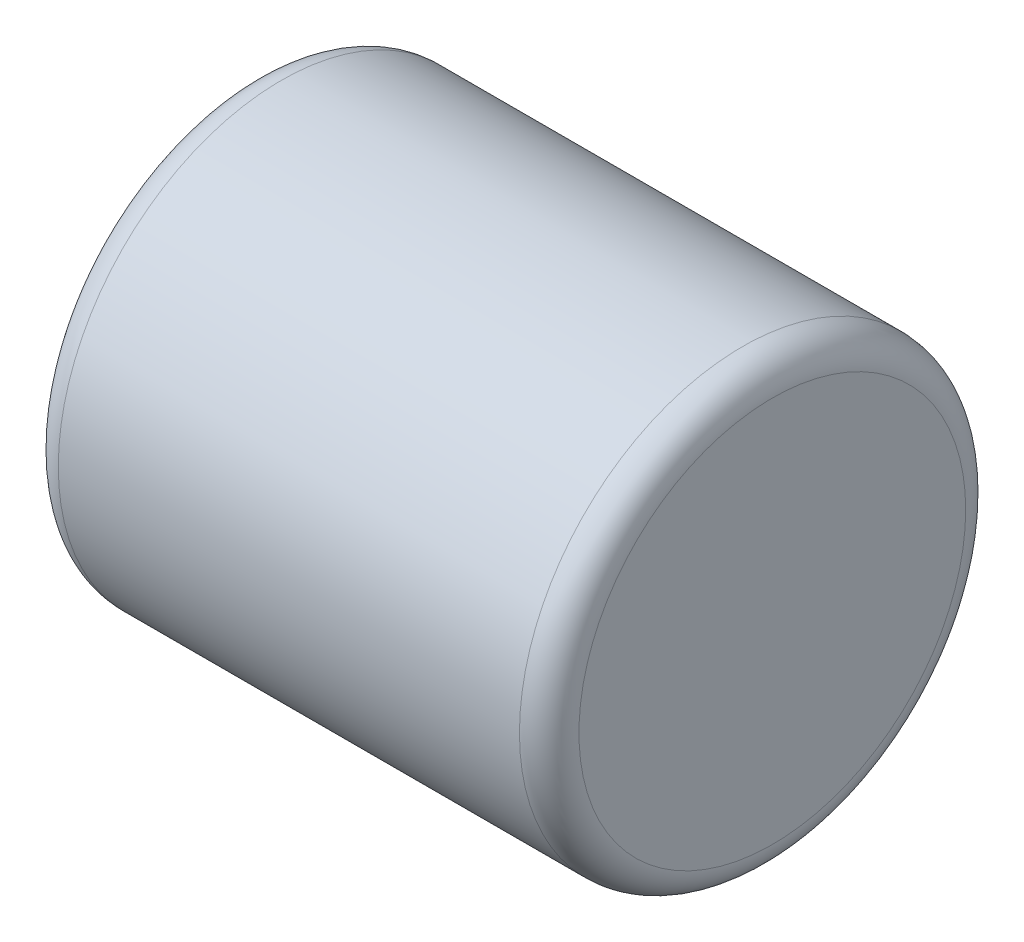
from build123d import *

# Parameters (mm, degrees)
ESQUISSE1_W = 3.5
ESQUISSE1_H = 1.5
CONG_1_R    = 0.2


with BuildPart() as part:
    # Esquisse1 → Base-R_volution (revolve)
    with BuildSketch(Plane.XY, mode=Mode.PRIVATE) as base_r_volution_sk:
        with Locations((1.75, 0.75)):
            Rectangle(ESQUISSE1_W, ESQUISSE1_H)
    revolve(base_r_volution_sk.sketch.rotate(Axis((-2.5, 0, 0), (1, 0, 0)), 90), axis=Axis((-2.5, 0, 0), (1, 0, 0)))

    # Cong_1
    cong_1_edges = [part.edges().sort_by_distance(p)[0] for p in [
        (3.5, 0, -1.5),
        (0, 0, -1.5),
    ]]
    fillet(cong_1_edges, radius=CONG_1_R)


solid = part.part
